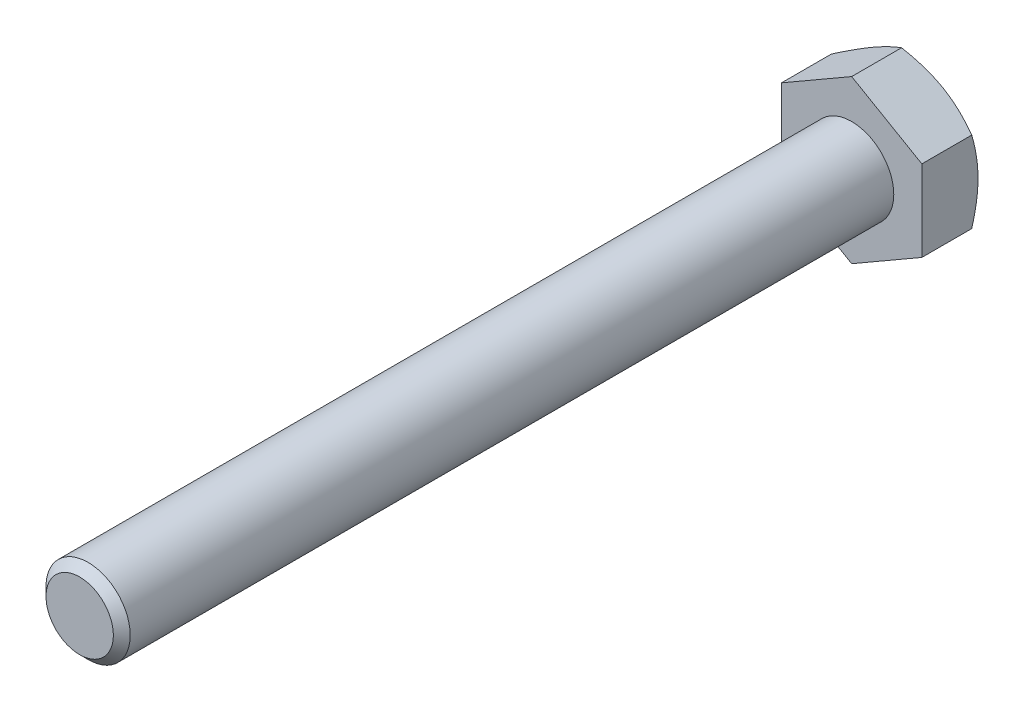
ISO-10303-21;
HEADER;
FILE_DESCRIPTION(('STEP AP214'),'2;1');
FILE_NAME('part.step','',(''),(''),'','','');
FILE_SCHEMA(('AUTOMOTIVE_DESIGN { 1 0 10303 214 1 1 1 1 }'));
ENDSEC;
DATA;
#1=APPLICATION_CONTEXT('core data for automotive mechanical design processes');
#2=APPLICATION_PROTOCOL_DEFINITION('international standard','automotive_design',2000,#1);
#3=PRODUCT_CONTEXT('',#1,'mechanical');
#4=PRODUCT('Part','Part','',(#3));
#5=PRODUCT_RELATED_PRODUCT_CATEGORY('part','',(#4));
#6=PRODUCT_DEFINITION_FORMATION('','',#4);
#7=PRODUCT_DEFINITION_CONTEXT('part definition',#1,'design');
#8=PRODUCT_DEFINITION('design','',#6,#7);
#9=PRODUCT_DEFINITION_SHAPE('','',#8);
#10=(LENGTH_UNIT() NAMED_UNIT(*) SI_UNIT(.MILLI.,.METRE.));
#11=(NAMED_UNIT(*) PLANE_ANGLE_UNIT() SI_UNIT($,.RADIAN.));
#12=(NAMED_UNIT(*) SI_UNIT($,.STERADIAN.) SOLID_ANGLE_UNIT());
#13=UNCERTAINTY_MEASURE_WITH_UNIT(LENGTH_MEASURE(1.E-05),#10,'distance_accuracy_value','');
#14=(GEOMETRIC_REPRESENTATION_CONTEXT(3) GLOBAL_UNCERTAINTY_ASSIGNED_CONTEXT((#13)) GLOBAL_UNIT_ASSIGNED_CONTEXT((#10,
#11,#12)) REPRESENTATION_CONTEXT('',''));
#15=CARTESIAN_POINT('',(0.,0.,0.));
#16=DIRECTION('',(0.,0.,1.));
#17=DIRECTION('',(1.,0.,0.));
#18=AXIS2_PLACEMENT_3D('',#15,#16,#17);
#19=CARTESIAN_POINT('',(0.,0.,55.));
#20=DIRECTION('',(0.,0.,1.));
#21=DIRECTION('',(1.,0.,0.));
#22=AXIS2_PLACEMENT_3D('',#19,#20,#21);
#23=PLANE('',#22);
#24=CARTESIAN_POINT('',(0.,0.,55.));
#25=DIRECTION('',(0.,0.,1.));
#26=DIRECTION('',(1.,0.,0.));
#27=AXIS2_PLACEMENT_3D('',#24,#25,#26);
#28=CIRCLE('',#27,2.4);
#29=CARTESIAN_POINT('',(2.40000000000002,0.,55.));
#30=VERTEX_POINT('',#29);
#31=EDGE_CURVE('E201',#30,#30,#28,.T.);
#32=ORIENTED_EDGE('',*,*,#31,.T.);
#33=EDGE_LOOP('',(#32));
#34=FACE_BOUND('',#33,.T.);
#35=ADVANCED_FACE('F27',(#34),#23,.T.);
#36=CARTESIAN_POINT('',(0.,0.,0.));
#37=DIRECTION('',(0.,0.,1.));
#38=DIRECTION('',(1.,0.,0.));
#39=AXIS2_PLACEMENT_3D('',#36,#37,#38);
#40=CYLINDRICAL_SURFACE('',#39,3.);
#41=CARTESIAN_POINT('',(0.,0.,54.4));
#42=DIRECTION('',(0.,0.,1.));
#43=DIRECTION('',(1.,0.,0.));
#44=AXIS2_PLACEMENT_3D('',#41,#42,#43);
#45=CIRCLE('',#44,3.);
#46=CARTESIAN_POINT('',(3.00000000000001,0.,54.4));
#47=VERTEX_POINT('',#46);
#48=EDGE_CURVE('E203',#47,#47,#45,.F.);
#49=ORIENTED_EDGE('',*,*,#48,.T.);
#50=EDGE_LOOP('',(#49));
#51=FACE_BOUND('',#50,.T.);
#52=CARTESIAN_POINT('',(0.,0.,0.));
#53=DIRECTION('',(0.,0.,1.));
#54=DIRECTION('',(1.,0.,0.));
#55=AXIS2_PLACEMENT_3D('',#52,#53,#54);
#56=CIRCLE('',#55,3.);
#57=CARTESIAN_POINT('',(3.,0.,0.));
#58=VERTEX_POINT('',#57);
#59=EDGE_CURVE('E204',#58,#58,#56,.F.);
#60=ORIENTED_EDGE('',*,*,#59,.F.);
#61=EDGE_LOOP('',(#60));
#62=FACE_BOUND('',#61,.T.);
#63=ADVANCED_FACE('F192',(#51,#62),#40,.T.);
#64=CARTESIAN_POINT('',(0.,0.,55.));
#65=DIRECTION('',(0.,0.,-1.));
#66=DIRECTION('',(-1.,0.,0.));
#67=AXIS2_PLACEMENT_3D('',#64,#65,#66);
#68=CONICAL_SURFACE('',#67,2.4,0.785398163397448);
#69=ORIENTED_EDGE('',*,*,#48,.F.);
#70=EDGE_LOOP('',(#69));
#71=FACE_BOUND('',#70,.T.);
#72=ORIENTED_EDGE('',*,*,#31,.F.);
#73=EDGE_LOOP('',(#72));
#74=FACE_BOUND('',#73,.T.);
#75=ADVANCED_FACE('F197',(#71,#74),#68,.T.);
#76=CARTESIAN_POINT('',(0.,5.77350269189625,-4.));
#77=DIRECTION('',(0.499999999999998,0.86602540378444,0.));
#78=DIRECTION('',(-0.86602540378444,0.499999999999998,0.));
#79=AXIS2_PLACEMENT_3D('',#76,#77,#78);
#80=PLANE('',#79);
#81=CARTESIAN_POINT('',(-0.000200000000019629,5.7736181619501,-3.55335134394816));
#82=CARTESIAN_POINT('',(0.21953459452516,5.6467543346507,-3.62661343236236));
#83=CARTESIAN_POINT('',(0.441148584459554,5.51880543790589,-3.69324867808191));
#84=CARTESIAN_POINT('',(0.888213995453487,5.26069210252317,-3.8095610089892));
#85=CARTESIAN_POINT('',(1.11367335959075,5.1305230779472,-3.85919695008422));
#86=CARTESIAN_POINT('',(1.56183230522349,4.8717783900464,-3.93644897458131));
#87=CARTESIAN_POINT('',(1.78446209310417,4.74324302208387,-3.96457962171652));
#88=CARTESIAN_POINT('',(2.11918990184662,4.54998783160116,-3.98980507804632));
#89=CARTESIAN_POINT('',(2.23084219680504,4.48552534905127,-3.99538654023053));
#90=CARTESIAN_POINT('',(2.45424997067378,4.35654081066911,-4.00079778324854));
#91=CARTESIAN_POINT('',(2.5660054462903,4.2920187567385,-4.0006277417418));
#92=CARTESIAN_POINT('',(2.87218423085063,4.11524635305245,-3.99224636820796));
#93=CARTESIAN_POINT('',(3.0665060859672,4.00305457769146,-3.97817022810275));
#94=CARTESIAN_POINT('',(3.45386010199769,3.77941563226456,-3.93353474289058));
#95=CARTESIAN_POINT('',(3.64689090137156,3.66796924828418,-3.9029601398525));
#96=CARTESIAN_POINT('',(4.03502534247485,3.44387972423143,-3.82653150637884));
#97=CARTESIAN_POINT('',(4.23007999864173,3.33126486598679,-3.78035362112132));
#98=CARTESIAN_POINT('',(4.61728034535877,3.1077146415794,-3.67554820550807));
#99=CARTESIAN_POINT('',(4.80943099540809,2.99677641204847,-3.61694529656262));
#100=CARTESIAN_POINT('',(5.00020000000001,2.8866358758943,-3.55335134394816));
#101=B_SPLINE_CURVE_WITH_KNOTS('',3,(#81,#82,#83,#84,#85,#86,#87,#88,#89,#90,#91,#92,#93,#94,
#95,#96,#97,#98,#99,#100),.UNSPECIFIED.,.F.,.F.,(4,2,2,2,2,2,2,2,2,4),(0.,0.792555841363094,
1.58701660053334,2.36181537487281,2.74884076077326,3.13585419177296,3.80962362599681,
4.48401723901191,5.17336882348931,5.86136694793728),.UNSPECIFIED.);
#102=CARTESIAN_POINT('',(0.,5.77350269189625,-3.55341801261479));
#103=VERTEX_POINT('',#102);
#104=CARTESIAN_POINT('',(2.5,4.33012701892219,-4.));
#105=VERTEX_POINT('',#104);
#106=EDGE_CURVE('E237',#103,#105,#101,.T.);
#107=ORIENTED_EDGE('',*,*,#106,.F.);
#108=DIRECTION('',(0.,0.,1.));
#109=VECTOR('',#108,1.);
#110=CARTESIAN_POINT('',(0.,5.77350269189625,-4.));
#111=LINE('',#110,#109);
#112=CARTESIAN_POINT('',(0.,5.77350269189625,0.));
#113=VERTEX_POINT('',#112);
#114=EDGE_CURVE('E211',#103,#113,#111,.T.);
#115=ORIENTED_EDGE('',*,*,#114,.T.);
#116=DIRECTION('',(-0.86602540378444,0.499999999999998,0.));
#117=VECTOR('',#116,1.);
#118=CARTESIAN_POINT('',(0.,5.77350269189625,0.));
#119=LINE('',#118,#117);
#120=CARTESIAN_POINT('',(5.,2.88675134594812,0.));
#121=VERTEX_POINT('',#120);
#122=EDGE_CURVE('E235',#121,#113,#119,.T.);
#123=ORIENTED_EDGE('',*,*,#122,.F.);
#124=DIRECTION('',(0.,0.,1.));
#125=VECTOR('',#124,1.);
#126=CARTESIAN_POINT('',(5.,2.88675134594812,-4.));
#127=LINE('',#126,#125);
#128=CARTESIAN_POINT('',(5.,2.88675134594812,-3.55341801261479));
#129=VERTEX_POINT('',#128);
#130=EDGE_CURVE('E208',#129,#121,#127,.T.);
#131=ORIENTED_EDGE('',*,*,#130,.F.);
#132=EDGE_CURVE('E167',#105,#129,#101,.T.);
#133=ORIENTED_EDGE('',*,*,#132,.F.);
#134=EDGE_LOOP('',(#107,#115,#123,#131,#133));
#135=FACE_BOUND('',#134,.T.);
#136=ADVANCED_FACE('F177',(#135),#80,.T.);
#137=CARTESIAN_POINT('',(5.,-2.88675134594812,-4.));
#138=DIRECTION('',(1.,0.,0.));
#139=DIRECTION('',(0.,0.,-1.));
#140=AXIS2_PLACEMENT_3D('',#137,#138,#139);
#141=PLANE('',#140);
#142=CARTESIAN_POINT('',(5.,-7.87365701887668,-1.5017575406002));
#143=CARTESIAN_POINT('',(5.,-7.65421637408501,-1.60868091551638));
#144=CARTESIAN_POINT('',(5.,-7.43428458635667,-1.71461296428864));
#145=CARTESIAN_POINT('',(5.,-6.99317792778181,-1.92393906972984));
#146=CARTESIAN_POINT('',(5.,-6.77200287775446,-2.02733274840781));
#147=CARTESIAN_POINT('',(5.,-6.32706593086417,-2.23152152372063));
#148=CARTESIAN_POINT('',(5.,-6.10329657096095,-2.3323004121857));
#149=CARTESIAN_POINT('',(5.,-5.65401907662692,-2.52988978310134));
#150=CARTESIAN_POINT('',(5.,-5.42851102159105,-2.62670044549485));
#151=CARTESIAN_POINT('',(5.,-4.96773019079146,-2.81850105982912));
#152=CARTESIAN_POINT('',(5.,-4.73238523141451,-2.91331851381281));
#153=CARTESIAN_POINT('',(5.,-4.2589865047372,-3.09606229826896));
#154=CARTESIAN_POINT('',(5.,-4.02093244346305,-3.18398787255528));
#155=CARTESIAN_POINT('',(5.,-3.54214478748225,-3.35072723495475));
#156=CARTESIAN_POINT('',(5.,-3.30141732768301,-3.42955846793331));
#157=CARTESIAN_POINT('',(5.,-2.81651125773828,-3.57565910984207));
#158=CARTESIAN_POINT('',(5.,-2.57233372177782,-3.64293203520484));
#159=CARTESIAN_POINT('',(5.,-2.08173956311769,-3.76241038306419));
#160=CARTESIAN_POINT('',(5.,-1.83534384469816,-3.81470009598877));
#161=CARTESIAN_POINT('',(5.,-1.33936717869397,-3.90133365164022));
#162=CARTESIAN_POINT('',(5.,-1.08978658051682,-3.93567944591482));
#163=CARTESIAN_POINT('',(5.,-0.59199465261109,-3.98324171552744));
#164=CARTESIAN_POINT('',(5.,-0.343810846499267,-3.99673913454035));
#165=CARTESIAN_POINT('',(5.,0.152820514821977,-4.00220795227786));
#166=CARTESIAN_POINT('',(5.,0.401268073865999,-3.99417903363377));
#167=CARTESIAN_POINT('',(5.,0.81953961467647,-3.96311999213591));
#168=CARTESIAN_POINT('',(5.,0.989794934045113,-3.94552930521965));
#169=CARTESIAN_POINT('',(5.,1.32912938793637,-3.90127081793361));
#170=CARTESIAN_POINT('',(5.,1.49820837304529,-3.87460188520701));
#171=CARTESIAN_POINT('',(5.,2.00341173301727,-3.78237229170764));
#172=CARTESIAN_POINT('',(5.,2.33733597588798,-3.7046029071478));
#173=CARTESIAN_POINT('',(5.,2.83691487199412,-3.56883106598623));
#174=CARTESIAN_POINT('',(5.,3.00513229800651,-3.51971360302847));
#175=CARTESIAN_POINT('',(5.,3.33993504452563,-3.41615110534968));
#176=CARTESIAN_POINT('',(5.,3.50652035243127,-3.36170602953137));
#177=CARTESIAN_POINT('',(5.,3.83810926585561,-3.24838071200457));
#178=CARTESIAN_POINT('',(5.,4.00311330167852,-3.18950171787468));
#179=CARTESIAN_POINT('',(5.,4.33173746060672,-3.06802383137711));
#180=CARTESIAN_POINT('',(5.,4.49535761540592,-3.00542502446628));
#181=CARTESIAN_POINT('',(5.,4.9359829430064,-2.83201950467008));
#182=CARTESIAN_POINT('',(5.,5.21182602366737,-2.71826266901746));
#183=CARTESIAN_POINT('',(5.,5.76066658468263,-2.48405585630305));
#184=CARTESIAN_POINT('',(5.,6.03366374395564,-2.3636051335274));
#185=CARTESIAN_POINT('',(5.,6.57746623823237,-2.11759609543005));
#186=CARTESIAN_POINT('',(5.,6.84827068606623,-1.99203582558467));
#187=CARTESIAN_POINT('',(5.,7.38802449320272,-1.73703058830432));
#188=CARTESIAN_POINT('',(5.,7.65697392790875,-1.60758577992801));
#189=CARTESIAN_POINT('',(5.,8.19381940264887,-1.34544789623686));
#190=CARTESIAN_POINT('',(5.,8.46171304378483,-1.21274991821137));
#191=CARTESIAN_POINT('',(5.,8.99628800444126,-0.944933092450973));
#192=CARTESIAN_POINT('',(5.,9.26296931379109,-0.809814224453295));
#193=CARTESIAN_POINT('',(5.,10.0614145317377,-0.40162739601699));
#194=CARTESIAN_POINT('',(5.,10.5917004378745,-0.12566969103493));
#195=CARTESIAN_POINT('',(5.,11.5934978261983,0.401869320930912));
#196=CARTESIAN_POINT('',(5.,12.0652823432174,0.652934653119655));
#197=CARTESIAN_POINT('',(5.,13.0072652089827,1.1580917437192));
#198=CARTESIAN_POINT('',(5.,13.4774634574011,1.41218368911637));
#199=CARTESIAN_POINT('',(5.,14.4150598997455,1.92174727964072));
#200=CARTESIAN_POINT('',(5.,14.8824621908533,2.17721139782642));
#201=CARTESIAN_POINT('',(5.,15.8162766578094,2.68985606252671));
#202=CARTESIAN_POINT('',(5.,16.2826889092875,2.94703647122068));
#203=CARTESIAN_POINT('',(5.,16.7487534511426,3.20484156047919));
#204=B_SPLINE_CURVE_WITH_KNOTS('',3,(#142,#143,#144,#145,#146,#147,#148,#149,#150,#151,#152,
#153,#154,#155,#156,#157,#158,#159,#160,#161,#162,#163,#164,#165,#166,#167,#168,#169,#170,#171,
#172,#173,#174,#175,#176,#177,#178,#179,#180,#181,#182,#183,#184,#185,#186,#187,#188,#189,#190,
#191,#192,#193,#194,#195,#196,#197,#198,#199,#200,#201,#202,#203),.UNSPECIFIED.,.F.,.F.,(4,2,2,
2,2,2,2,2,2,2,2,2,2,2,2,2,2,2,2,2,2,2,2,2,2,2,2,2,2,2,4),(0.,0.732320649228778,1.46474969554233,
2.20096737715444,2.93715163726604,3.6982503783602,4.45943251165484,5.21912936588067,
5.97859468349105,6.73369963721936,7.48872245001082,8.23347928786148,8.97824710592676,
9.49148539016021,10.0047877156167,11.0318914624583,11.5575684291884,12.0832494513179,
12.6087831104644,13.1343047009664,14.029309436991,14.9244140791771,15.819864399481,
16.7152781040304,17.612136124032,18.5090016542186,20.3023290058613,21.9056050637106,
23.5089806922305,25.106957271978,26.7048070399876),.UNSPECIFIED.);
#205=CARTESIAN_POINT('',(5.,0.,-4.));
#206=VERTEX_POINT('',#205);
#207=EDGE_CURVE('E165',#129,#206,#204,.F.);
#208=ORIENTED_EDGE('',*,*,#207,.F.);
#209=ORIENTED_EDGE('',*,*,#130,.T.);
#210=DIRECTION('',(0.,1.,0.));
#211=VECTOR('',#210,1.);
#212=CARTESIAN_POINT('',(5.,-2.88675134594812,0.));
#213=LINE('',#212,#211);
#214=CARTESIAN_POINT('',(5.,-2.88675134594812,0.));
#215=VERTEX_POINT('',#214);
#216=EDGE_CURVE('E213',#215,#121,#213,.T.);
#217=ORIENTED_EDGE('',*,*,#216,.F.);
#218=DIRECTION('',(0.,0.,1.));
#219=VECTOR('',#218,1.);
#220=CARTESIAN_POINT('',(5.,-2.88675134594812,-4.));
#221=LINE('',#220,#219);
#222=CARTESIAN_POINT('',(5.,-2.88675134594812,-3.55341801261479));
#223=VERTEX_POINT('',#222);
#224=EDGE_CURVE('E219',#223,#215,#221,.T.);
#225=ORIENTED_EDGE('',*,*,#224,.F.);
#226=EDGE_CURVE('E160',#206,#223,#204,.F.);
#227=ORIENTED_EDGE('',*,*,#226,.F.);
#228=EDGE_LOOP('',(#208,#209,#217,#225,#227));
#229=FACE_BOUND('',#228,.T.);
#230=ADVANCED_FACE('F173',(#229),#141,.T.);
#231=CARTESIAN_POINT('',(0.,-5.77350269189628,-4.));
#232=DIRECTION('',(0.499999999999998,-0.86602540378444,0.));
#233=DIRECTION('',(0.86602540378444,0.499999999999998,0.));
#234=AXIS2_PLACEMENT_3D('',#231,#232,#233);
#235=PLANE('',#234);
#236=CARTESIAN_POINT('',(5.0002,-2.8866358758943,-3.55335134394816));
#237=CARTESIAN_POINT('',(4.78046540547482,-3.0134997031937,-3.62661343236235));
#238=CARTESIAN_POINT('',(4.55885141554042,-3.14144859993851,-3.6932486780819));
#239=CARTESIAN_POINT('',(4.11178600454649,-3.39956193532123,-3.80956100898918));
#240=CARTESIAN_POINT('',(3.88632664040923,-3.5297309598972,-3.8591969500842));
#241=CARTESIAN_POINT('',(3.4381676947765,-3.78847564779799,-3.93644897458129));
#242=CARTESIAN_POINT('',(3.21553790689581,-3.91701101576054,-3.9645796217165));
#243=CARTESIAN_POINT('',(2.88081009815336,-4.11026620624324,-3.9898050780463));
#244=CARTESIAN_POINT('',(2.76915780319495,-4.17472868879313,-3.9953865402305));
#245=CARTESIAN_POINT('',(2.54575002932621,-4.30371322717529,-4.00079778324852));
#246=CARTESIAN_POINT('',(2.43399455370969,-4.3682352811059,-4.00062774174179));
#247=CARTESIAN_POINT('',(2.12781576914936,-4.54500768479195,-3.99224636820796));
#248=CARTESIAN_POINT('',(1.93349391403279,-4.65719946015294,-3.97817022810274));
#249=CARTESIAN_POINT('',(1.5461398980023,-4.88083840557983,-3.93353474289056));
#250=CARTESIAN_POINT('',(1.35310909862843,-4.99228478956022,-3.90296013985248));
#251=CARTESIAN_POINT('',(0.964974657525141,-5.21637431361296,-3.82653150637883));
#252=CARTESIAN_POINT('',(0.769920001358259,-5.3289891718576,-3.78035362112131));
#253=CARTESIAN_POINT('',(0.382719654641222,-5.552539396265,-3.67554820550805));
#254=CARTESIAN_POINT('',(0.190569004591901,-5.66347762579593,-3.61694529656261));
#255=CARTESIAN_POINT('',(-0.000200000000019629,-5.7736181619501,-3.55335134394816));
#256=B_SPLINE_CURVE_WITH_KNOTS('',3,(#236,#237,#238,#239,#240,#241,#242,#243,#244,#245,#246,
#247,#248,#249,#250,#251,#252,#253,#254,#255),.UNSPECIFIED.,.F.,.F.,(4,2,2,2,2,2,2,2,2,4),(0.,
0.792555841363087,1.58701660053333,2.3618153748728,2.74884076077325,3.13585419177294,
3.80962362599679,4.48401723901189,5.17336882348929,5.86136694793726),.UNSPECIFIED.);
#257=CARTESIAN_POINT('',(2.49999999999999,-4.33012701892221,-4.));
#258=VERTEX_POINT('',#257);
#259=EDGE_CURVE('E166',#223,#258,#256,.T.);
#260=ORIENTED_EDGE('',*,*,#259,.F.);
#261=ORIENTED_EDGE('',*,*,#224,.T.);
#262=DIRECTION('',(0.86602540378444,0.499999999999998,0.));
#263=VECTOR('',#262,1.);
#264=CARTESIAN_POINT('',(0.,-5.77350269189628,0.));
#265=LINE('',#264,#263);
#266=CARTESIAN_POINT('',(0.,-5.77350269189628,0.));
#267=VERTEX_POINT('',#266);
#268=EDGE_CURVE('E224',#267,#215,#265,.T.);
#269=ORIENTED_EDGE('',*,*,#268,.F.);
#270=DIRECTION('',(0.,0.,1.));
#271=VECTOR('',#270,1.);
#272=CARTESIAN_POINT('',(0.,-5.77350269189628,-4.));
#273=LINE('',#272,#271);
#274=CARTESIAN_POINT('',(0.,-5.77350269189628,-3.55341801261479));
#275=VERTEX_POINT('',#274);
#276=EDGE_CURVE('E217',#275,#267,#273,.T.);
#277=ORIENTED_EDGE('',*,*,#276,.F.);
#278=EDGE_CURVE('E154',#258,#275,#256,.T.);
#279=ORIENTED_EDGE('',*,*,#278,.F.);
#280=EDGE_LOOP('',(#260,#261,#269,#277,#279));
#281=FACE_BOUND('',#280,.T.);
#282=ADVANCED_FACE('F176',(#281),#235,.T.);
#283=CARTESIAN_POINT('',(0.,-5.77350269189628,-4.));
#284=DIRECTION('',(-0.500000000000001,-0.866025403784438,0.));
#285=DIRECTION('',(0.866025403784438,-0.500000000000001,0.));
#286=AXIS2_PLACEMENT_3D('',#283,#284,#285);
#287=PLANE('',#286);
#288=CARTESIAN_POINT('',(0.000199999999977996,-5.77361816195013,-3.55335134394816));
#289=CARTESIAN_POINT('',(-0.219534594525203,-5.64675433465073,-3.62661343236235));
#290=CARTESIAN_POINT('',(-0.441148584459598,-5.51880543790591,-3.6932486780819));
#291=CARTESIAN_POINT('',(-0.888213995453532,-5.26069210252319,-3.80956100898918));
#292=CARTESIAN_POINT('',(-1.11367335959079,-5.13052307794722,-3.8591969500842));
#293=CARTESIAN_POINT('',(-1.56183230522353,-4.87177839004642,-3.93644897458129));
#294=CARTESIAN_POINT('',(-1.78446209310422,-4.74324302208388,-3.9645796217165));
#295=CARTESIAN_POINT('',(-2.11918990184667,-4.54998783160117,-3.9898050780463));
#296=CARTESIAN_POINT('',(-2.23084219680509,-4.48552534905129,-3.99538654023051));
#297=CARTESIAN_POINT('',(-2.45424997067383,-4.35654081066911,-4.00079778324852));
#298=CARTESIAN_POINT('',(-2.56600544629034,-4.29201875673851,-4.00062774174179));
#299=CARTESIAN_POINT('',(-2.87218423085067,-4.11524635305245,-3.99224636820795));
#300=CARTESIAN_POINT('',(-3.06650608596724,-4.00305457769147,-3.97817022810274));
#301=CARTESIAN_POINT('',(-3.45386010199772,-3.77941563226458,-3.93353474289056));
#302=CARTESIAN_POINT('',(-3.64689090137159,-3.66796924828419,-3.90296013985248));
#303=CARTESIAN_POINT('',(-4.03502534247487,-3.44387972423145,-3.82653150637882));
#304=CARTESIAN_POINT('',(-4.23007999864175,-3.33126486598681,-3.78035362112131));
#305=CARTESIAN_POINT('',(-4.61728034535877,-3.10771464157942,-3.67554820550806));
#306=CARTESIAN_POINT('',(-4.80943099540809,-2.99677641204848,-3.61694529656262));
#307=CARTESIAN_POINT('',(-5.0002,-2.8866358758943,-3.55335134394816));
#308=B_SPLINE_CURVE_WITH_KNOTS('',3,(#288,#289,#290,#291,#292,#293,#294,#295,#296,#297,#298,
#299,#300,#301,#302,#303,#304,#305,#306,#307),.UNSPECIFIED.,.F.,.F.,(4,2,2,2,2,2,2,2,2,4),(0.,
0.792555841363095,1.58701660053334,2.36181537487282,2.74884076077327,3.13585419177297,
3.8096236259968,4.4840172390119,5.17336882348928,5.86136694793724),.UNSPECIFIED.);
#309=CARTESIAN_POINT('',(-2.5,-4.33012701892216,-4.));
#310=VERTEX_POINT('',#309);
#311=EDGE_CURVE('E256',#275,#310,#308,.T.);
#312=ORIENTED_EDGE('',*,*,#311,.F.);
#313=ORIENTED_EDGE('',*,*,#276,.T.);
#314=DIRECTION('',(0.866025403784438,-0.500000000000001,0.));
#315=VECTOR('',#314,1.);
#316=CARTESIAN_POINT('',(0.,-5.77350269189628,0.));
#317=LINE('',#316,#315);
#318=CARTESIAN_POINT('',(-5.,-2.88675134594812,0.));
#319=VERTEX_POINT('',#318);
#320=EDGE_CURVE('E227',#319,#267,#317,.T.);
#321=ORIENTED_EDGE('',*,*,#320,.F.);
#322=DIRECTION('',(0.,0.,1.));
#323=VECTOR('',#322,1.);
#324=CARTESIAN_POINT('',(-5.,-2.88675134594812,-4.));
#325=LINE('',#324,#323);
#326=CARTESIAN_POINT('',(-5.,-2.88675134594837,-3.55341801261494));
#327=VERTEX_POINT('',#326);
#328=EDGE_CURVE('E215',#327,#319,#325,.T.);
#329=ORIENTED_EDGE('',*,*,#328,.F.);
#330=EDGE_CURVE('E103',#310,#327,#308,.T.);
#331=ORIENTED_EDGE('',*,*,#330,.F.);
#332=EDGE_LOOP('',(#312,#313,#321,#329,#331));
#333=FACE_BOUND('',#332,.T.);
#334=ADVANCED_FACE('F181',(#333),#287,.T.);
#335=CARTESIAN_POINT('',(-5.,-2.88675134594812,-4.));
#336=DIRECTION('',(-1.,0.,0.));
#337=DIRECTION('',(0.,0.,1.));
#338=AXIS2_PLACEMENT_3D('',#335,#336,#337);
#339=PLANE('',#338);
#340=CARTESIAN_POINT('',(-4.99999999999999,-7.87365701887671,-1.5017575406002));
#341=CARTESIAN_POINT('',(-5.,-7.65421637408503,-1.60868091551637));
#342=CARTESIAN_POINT('',(-5.,-7.43428458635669,-1.71461296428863));
#343=CARTESIAN_POINT('',(-5.00000000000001,-6.99317792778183,-1.92393906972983));
#344=CARTESIAN_POINT('',(-5.,-6.77200287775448,-2.0273327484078));
#345=CARTESIAN_POINT('',(-5.,-6.32706593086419,-2.23152152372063));
#346=CARTESIAN_POINT('',(-5.,-6.10329657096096,-2.3323004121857));
#347=CARTESIAN_POINT('',(-5.,-5.65401907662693,-2.52988978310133));
#348=CARTESIAN_POINT('',(-5.,-5.42851102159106,-2.62670044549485));
#349=CARTESIAN_POINT('',(-5.,-4.96773019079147,-2.81850105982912));
#350=CARTESIAN_POINT('',(-5.,-4.73238523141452,-2.91331851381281));
#351=CARTESIAN_POINT('',(-5.,-4.2589865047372,-3.09606229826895));
#352=CARTESIAN_POINT('',(-5.,-4.02093244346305,-3.18398787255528));
#353=CARTESIAN_POINT('',(-5.,-3.54214478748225,-3.35072723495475));
#354=CARTESIAN_POINT('',(-5.,-3.30141732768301,-3.4295584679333));
#355=CARTESIAN_POINT('',(-5.,-2.81651125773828,-3.57565910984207));
#356=CARTESIAN_POINT('',(-5.,-2.57233372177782,-3.64293203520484));
#357=CARTESIAN_POINT('',(-5.,-2.08173956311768,-3.7624103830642));
#358=CARTESIAN_POINT('',(-5.,-1.83534384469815,-3.81470009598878));
#359=CARTESIAN_POINT('',(-5.,-1.33936717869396,-3.90133365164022));
#360=CARTESIAN_POINT('',(-5.,-1.08978658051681,-3.93567944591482));
#361=CARTESIAN_POINT('',(-5.,-0.591994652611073,-3.98324171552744));
#362=CARTESIAN_POINT('',(-5.,-0.343810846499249,-3.99673913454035));
#363=CARTESIAN_POINT('',(-5.,0.152820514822,-4.00220795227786));
#364=CARTESIAN_POINT('',(-5.,0.401268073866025,-3.99417903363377));
#365=CARTESIAN_POINT('',(-5.,0.819539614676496,-3.96311999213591));
#366=CARTESIAN_POINT('',(-5.,0.989794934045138,-3.94552930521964));
#367=CARTESIAN_POINT('',(-5.,1.32912938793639,-3.90127081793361));
#368=CARTESIAN_POINT('',(-5.,1.49820837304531,-3.874601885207));
#369=CARTESIAN_POINT('',(-5.,2.00341173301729,-3.78237229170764));
#370=CARTESIAN_POINT('',(-5.,2.33733597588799,-3.70460290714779));
#371=CARTESIAN_POINT('',(-5.,2.83691487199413,-3.56883106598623));
#372=CARTESIAN_POINT('',(-5.,3.00513229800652,-3.51971360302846));
#373=CARTESIAN_POINT('',(-5.,3.33993504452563,-3.41615110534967));
#374=CARTESIAN_POINT('',(-5.,3.50652035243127,-3.36170602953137));
#375=CARTESIAN_POINT('',(-5.00000000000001,3.83810926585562,-3.24838071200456));
#376=CARTESIAN_POINT('',(-5.00000000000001,4.00311330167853,-3.18950171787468));
#377=CARTESIAN_POINT('',(-5.,4.33173746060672,-3.06802383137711));
#378=CARTESIAN_POINT('',(-4.99999999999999,4.49535761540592,-3.00542502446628));
#379=CARTESIAN_POINT('',(-4.99999999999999,4.9359829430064,-2.83201950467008));
#380=CARTESIAN_POINT('',(-5.,5.21182602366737,-2.71826266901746));
#381=CARTESIAN_POINT('',(-5.00000000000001,5.76066658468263,-2.48405585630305));
#382=CARTESIAN_POINT('',(-5.00000000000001,6.03366374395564,-2.3636051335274));
#383=CARTESIAN_POINT('',(-5.,6.57746623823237,-2.11759609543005));
#384=CARTESIAN_POINT('',(-5.,6.84827068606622,-1.99203582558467));
#385=CARTESIAN_POINT('',(-5.,7.38802449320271,-1.73703058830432));
#386=CARTESIAN_POINT('',(-5.,7.65697392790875,-1.60758577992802));
#387=CARTESIAN_POINT('',(-5.,8.19381940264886,-1.34544789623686));
#388=CARTESIAN_POINT('',(-5.,8.46171304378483,-1.21274991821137));
#389=CARTESIAN_POINT('',(-5.,8.99628800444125,-0.944933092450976));
#390=CARTESIAN_POINT('',(-5.,9.26296931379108,-0.809814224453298));
#391=CARTESIAN_POINT('',(-5.,10.0614145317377,-0.401627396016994));
#392=CARTESIAN_POINT('',(-5.,10.5917004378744,-0.125669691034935));
#393=CARTESIAN_POINT('',(-5.,11.5934978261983,0.401869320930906));
#394=CARTESIAN_POINT('',(-5.,12.0652823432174,0.652934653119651));
#395=CARTESIAN_POINT('',(-5.,13.0072652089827,1.1580917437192));
#396=CARTESIAN_POINT('',(-5.,13.4774634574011,1.41218368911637));
#397=CARTESIAN_POINT('',(-5.,14.4150598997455,1.92174727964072));
#398=CARTESIAN_POINT('',(-5.,14.8824621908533,2.17721139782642));
#399=CARTESIAN_POINT('',(-5.,15.8162766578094,2.68985606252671));
#400=CARTESIAN_POINT('',(-5.,16.2826889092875,2.94703647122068));
#401=CARTESIAN_POINT('',(-5.,16.7487534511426,3.20484156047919));
#402=B_SPLINE_CURVE_WITH_KNOTS('',3,(#340,#341,#342,#343,#344,#345,#346,#347,#348,#349,#350,
#351,#352,#353,#354,#355,#356,#357,#358,#359,#360,#361,#362,#363,#364,#365,#366,#367,#368,#369,
#370,#371,#372,#373,#374,#375,#376,#377,#378,#379,#380,#381,#382,#383,#384,#385,#386,#387,#388,
#389,#390,#391,#392,#393,#394,#395,#396,#397,#398,#399,#400,#401),.UNSPECIFIED.,.F.,.F.,(4,2,2,
2,2,2,2,2,2,2,2,2,2,2,2,2,2,2,2,2,2,2,2,2,2,2,2,2,2,2,4),(0.,0.732320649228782,1.46474969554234,
2.20096737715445,2.93715163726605,3.69825037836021,4.45943251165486,5.2191293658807,
5.97859468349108,6.73369963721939,7.48872245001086,8.23347928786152,8.97824710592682,
9.49148539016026,10.0047877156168,11.0318914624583,11.5575684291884,12.0832494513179,
12.6087831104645,13.1343047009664,14.0293094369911,14.9244140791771,15.819864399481,
16.7152781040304,17.612136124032,18.5090016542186,20.3023290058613,21.9056050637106,
23.5089806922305,25.106957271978,26.7048070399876),.UNSPECIFIED.);
#403=CARTESIAN_POINT('',(-5.,0.,-4.));
#404=VERTEX_POINT('',#403);
#405=EDGE_CURVE('E98',#327,#404,#402,.T.);
#406=ORIENTED_EDGE('',*,*,#405,.F.);
#407=ORIENTED_EDGE('',*,*,#328,.T.);
#408=DIRECTION('',(0.,-1.,0.));
#409=VECTOR('',#408,1.);
#410=CARTESIAN_POINT('',(-5.,-2.88675134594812,0.));
#411=LINE('',#410,#409);
#412=CARTESIAN_POINT('',(-4.99999999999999,2.88675134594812,0.));
#413=VERTEX_POINT('',#412);
#414=EDGE_CURVE('E230',#413,#319,#411,.T.);
#415=ORIENTED_EDGE('',*,*,#414,.F.);
#416=DIRECTION('',(0.,0.,1.));
#417=VECTOR('',#416,1.);
#418=CARTESIAN_POINT('',(-4.99999999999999,2.88675134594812,-4.));
#419=LINE('',#418,#417);
#420=CARTESIAN_POINT('',(-4.99999999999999,2.88675134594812,-3.55341801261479));
#421=VERTEX_POINT('',#420);
#422=EDGE_CURVE('E124',#421,#413,#419,.T.);
#423=ORIENTED_EDGE('',*,*,#422,.F.);
#424=EDGE_CURVE('E107',#404,#421,#402,.T.);
#425=ORIENTED_EDGE('',*,*,#424,.F.);
#426=EDGE_LOOP('',(#406,#407,#415,#423,#425));
#427=FACE_BOUND('',#426,.T.);
#428=ADVANCED_FACE('F122',(#427),#339,.T.);
#429=CARTESIAN_POINT('',(-4.99999999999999,2.88675134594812,-4.));
#430=DIRECTION('',(-0.500000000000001,0.866025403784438,0.));
#431=DIRECTION('',(-0.866025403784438,-0.500000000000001,0.));
#432=AXIS2_PLACEMENT_3D('',#429,#430,#431);
#433=PLANE('',#432);
#434=CARTESIAN_POINT('',(-5.0002,2.8866358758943,-3.55335134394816));
#435=CARTESIAN_POINT('',(-4.78046540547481,3.01349970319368,-3.62661343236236));
#436=CARTESIAN_POINT('',(-4.55885141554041,3.14144859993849,-3.69324867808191));
#437=CARTESIAN_POINT('',(-4.11178600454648,3.3995619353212,-3.80956100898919));
#438=CARTESIAN_POINT('',(-3.88632664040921,3.52973095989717,-3.85919695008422));
#439=CARTESIAN_POINT('',(-3.43816769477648,3.78847564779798,-3.9364489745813));
#440=CARTESIAN_POINT('',(-3.2155379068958,3.91701101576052,-3.96457962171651));
#441=CARTESIAN_POINT('',(-2.88081009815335,4.11026620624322,-3.98980507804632));
#442=CARTESIAN_POINT('',(-2.76915780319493,4.17472868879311,-3.99538654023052));
#443=CARTESIAN_POINT('',(-2.54575002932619,4.30371322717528,-4.00079778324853));
#444=CARTESIAN_POINT('',(-2.43399455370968,4.36823528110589,-4.00062774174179));
#445=CARTESIAN_POINT('',(-2.12781576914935,4.54500768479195,-3.99224636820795));
#446=CARTESIAN_POINT('',(-1.93349391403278,4.65719946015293,-3.97817022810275));
#447=CARTESIAN_POINT('',(-1.54613989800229,4.88083840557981,-3.93353474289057));
#448=CARTESIAN_POINT('',(-1.35310909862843,4.9922847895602,-3.90296013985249));
#449=CARTESIAN_POINT('',(-0.964974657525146,5.21637431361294,-3.82653150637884));
#450=CARTESIAN_POINT('',(-0.769920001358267,5.32898917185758,-3.78035362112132));
#451=CARTESIAN_POINT('',(-0.38271965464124,5.55253939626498,-3.67554820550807));
#452=CARTESIAN_POINT('',(-0.190569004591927,5.66347762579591,-3.61694529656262));
#453=CARTESIAN_POINT('',(0.000199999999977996,5.7736181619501,-3.55335134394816));
#454=B_SPLINE_CURVE_WITH_KNOTS('',3,(#434,#435,#436,#437,#438,#439,#440,#441,#442,#443,#444,
#445,#446,#447,#448,#449,#450,#451,#452,#453),.UNSPECIFIED.,.F.,.F.,(4,2,2,2,2,2,2,2,2,4),(0.,
0.792555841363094,1.58701660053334,2.36181537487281,2.74884076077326,3.13585419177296,
3.80962362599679,4.48401723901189,5.17336882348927,5.86136694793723),.UNSPECIFIED.);
#455=CARTESIAN_POINT('',(-2.5,4.33012701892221,-4.));
#456=VERTEX_POINT('',#455);
#457=EDGE_CURVE('E113',#421,#456,#454,.T.);
#458=ORIENTED_EDGE('',*,*,#457,.F.);
#459=ORIENTED_EDGE('',*,*,#422,.T.);
#460=DIRECTION('',(-0.866025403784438,-0.500000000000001,0.));
#461=VECTOR('',#460,1.);
#462=CARTESIAN_POINT('',(-4.99999999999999,2.88675134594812,0.));
#463=LINE('',#462,#461);
#464=EDGE_CURVE('E233',#113,#413,#463,.T.);
#465=ORIENTED_EDGE('',*,*,#464,.F.);
#466=ORIENTED_EDGE('',*,*,#114,.F.);
#467=EDGE_CURVE('E115',#456,#103,#454,.T.);
#468=ORIENTED_EDGE('',*,*,#467,.F.);
#469=EDGE_LOOP('',(#458,#459,#465,#466,#468));
#470=FACE_BOUND('',#469,.T.);
#471=ADVANCED_FACE('F189',(#470),#433,.T.);
#472=CARTESIAN_POINT('',(5.,2.88675134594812,0.));
#473=DIRECTION('',(0.,0.,1.));
#474=DIRECTION('',(1.,0.,0.));
#475=AXIS2_PLACEMENT_3D('',#472,#473,#474);
#476=PLANE('',#475);
#477=ORIENTED_EDGE('',*,*,#59,.T.);
#478=EDGE_LOOP('',(#477));
#479=FACE_BOUND('',#478,.T.);
#480=ORIENTED_EDGE('',*,*,#122,.T.);
#481=ORIENTED_EDGE('',*,*,#464,.T.);
#482=ORIENTED_EDGE('',*,*,#414,.T.);
#483=ORIENTED_EDGE('',*,*,#320,.T.);
#484=ORIENTED_EDGE('',*,*,#268,.T.);
#485=ORIENTED_EDGE('',*,*,#216,.T.);
#486=EDGE_LOOP('',(#480,#481,#482,#483,#484,#485));
#487=FACE_BOUND('',#486,.T.);
#488=ADVANCED_FACE('F146',(#479,#487),#476,.T.);
#489=CARTESIAN_POINT('',(0.,0.,0.));
#490=DIRECTION('',(0.,0.,1.));
#491=DIRECTION('',(1.,0.,0.));
#492=AXIS2_PLACEMENT_3D('',#489,#490,#491);
#493=CONICAL_SURFACE('',#492,11.9282032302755,1.0471975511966);
#494=ORIENTED_EDGE('',*,*,#132,.T.);
#495=ORIENTED_EDGE('',*,*,#207,.T.);
#496=CARTESIAN_POINT('',(0.,0.,-4.));
#497=DIRECTION('',(0.,0.,1.));
#498=DIRECTION('',(1.,0.,0.));
#499=AXIS2_PLACEMENT_3D('',#496,#497,#498);
#500=CIRCLE('',#499,5.);
#501=EDGE_CURVE('E30',#105,#206,#500,.F.);
#502=ORIENTED_EDGE('',*,*,#501,.F.);
#503=EDGE_LOOP('',(#494,#495,#502));
#504=FACE_BOUND('',#503,.T.);
#505=ADVANCED_FACE('F246',(#504),#493,.T.);
#506=ORIENTED_EDGE('',*,*,#106,.T.);
#507=EDGE_CURVE('E120',#456,#105,#500,.F.);
#508=ORIENTED_EDGE('',*,*,#507,.F.);
#509=ORIENTED_EDGE('',*,*,#467,.T.);
#510=EDGE_LOOP('',(#506,#508,#509));
#511=FACE_BOUND('',#510,.T.);
#512=ADVANCED_FACE('F145',(#511),#493,.T.);
#513=ORIENTED_EDGE('',*,*,#424,.T.);
#514=ORIENTED_EDGE('',*,*,#457,.T.);
#515=CARTESIAN_POINT('',(0.,0.,-4.));
#516=DIRECTION('',(0.,0.,-1.));
#517=DIRECTION('',(-1.,0.,0.));
#518=AXIS2_PLACEMENT_3D('',#515,#516,#517);
#519=CIRCLE('',#518,5.);
#520=EDGE_CURVE('E48',#404,#456,#519,.T.);
#521=ORIENTED_EDGE('',*,*,#520,.F.);
#522=EDGE_LOOP('',(#513,#514,#521));
#523=FACE_BOUND('',#522,.T.);
#524=ADVANCED_FACE('F111',(#523),#493,.T.);
#525=ORIENTED_EDGE('',*,*,#330,.T.);
#526=ORIENTED_EDGE('',*,*,#405,.T.);
#527=EDGE_CURVE('E100',#310,#404,#500,.F.);
#528=ORIENTED_EDGE('',*,*,#527,.F.);
#529=EDGE_LOOP('',(#525,#526,#528));
#530=FACE_BOUND('',#529,.T.);
#531=ADVANCED_FACE('F99',(#530),#493,.T.);
#532=ORIENTED_EDGE('',*,*,#278,.T.);
#533=ORIENTED_EDGE('',*,*,#311,.T.);
#534=EDGE_CURVE('E35',#258,#310,#500,.F.);
#535=ORIENTED_EDGE('',*,*,#534,.F.);
#536=EDGE_LOOP('',(#532,#533,#535));
#537=FACE_BOUND('',#536,.T.);
#538=ADVANCED_FACE('F258',(#537),#493,.T.);
#539=ORIENTED_EDGE('',*,*,#226,.T.);
#540=ORIENTED_EDGE('',*,*,#259,.T.);
#541=EDGE_CURVE('E11',#206,#258,#500,.F.);
#542=ORIENTED_EDGE('',*,*,#541,.F.);
#543=EDGE_LOOP('',(#539,#540,#542));
#544=FACE_BOUND('',#543,.T.);
#545=ADVANCED_FACE('F253',(#544),#493,.T.);
#546=CARTESIAN_POINT('',(5.,2.88675134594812,-4.));
#547=DIRECTION('',(0.,0.,1.));
#548=DIRECTION('',(1.,0.,0.));
#549=AXIS2_PLACEMENT_3D('',#546,#547,#548);
#550=PLANE('',#549);
#551=ORIENTED_EDGE('',*,*,#501,.T.);
#552=ORIENTED_EDGE('',*,*,#541,.T.);
#553=ORIENTED_EDGE('',*,*,#534,.T.);
#554=ORIENTED_EDGE('',*,*,#527,.T.);
#555=ORIENTED_EDGE('',*,*,#520,.T.);
#556=ORIENTED_EDGE('',*,*,#507,.T.);
#557=EDGE_LOOP('',(#551,#552,#553,#554,#555,#556));
#558=FACE_BOUND('',#557,.T.);
#559=ADVANCED_FACE('F118',(#558),#550,.F.);
#560=CLOSED_SHELL('',(#35,#63,#75,#136,#230,#282,#334,#428,#471,#488,#505,#512,#524,#531,#538,
#545,#559));
#561=MANIFOLD_SOLID_BREP('B2',#560);
#562=ADVANCED_BREP_SHAPE_REPRESENTATION('',(#18,#561),#14);
#563=SHAPE_DEFINITION_REPRESENTATION(#9,#562);
ENDSEC;
END-ISO-10303-21;
